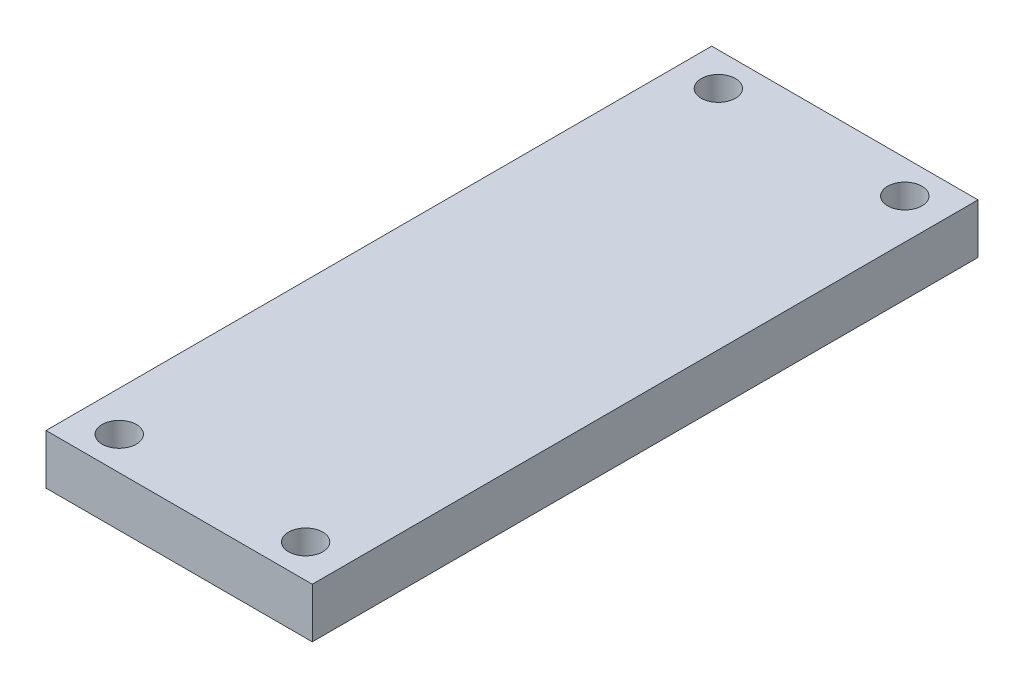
ISO-10303-21;
HEADER;
FILE_DESCRIPTION(('STEP AP214'),'2;1');
FILE_NAME('part.step','',(''),(''),'','','');
FILE_SCHEMA(('AUTOMOTIVE_DESIGN { 1 0 10303 214 1 1 1 1 }'));
ENDSEC;
DATA;
#1=APPLICATION_CONTEXT('core data for automotive mechanical design processes');
#2=APPLICATION_PROTOCOL_DEFINITION('international standard','automotive_design',2000,#1);
#3=PRODUCT_CONTEXT('',#1,'mechanical');
#4=PRODUCT('Part','Part','',(#3));
#5=PRODUCT_RELATED_PRODUCT_CATEGORY('part','',(#4));
#6=PRODUCT_DEFINITION_FORMATION('','',#4);
#7=PRODUCT_DEFINITION_CONTEXT('part definition',#1,'design');
#8=PRODUCT_DEFINITION('design','',#6,#7);
#9=PRODUCT_DEFINITION_SHAPE('','',#8);
#10=(LENGTH_UNIT() NAMED_UNIT(*) SI_UNIT(.MILLI.,.METRE.));
#11=(NAMED_UNIT(*) PLANE_ANGLE_UNIT() SI_UNIT($,.RADIAN.));
#12=(NAMED_UNIT(*) SI_UNIT($,.STERADIAN.) SOLID_ANGLE_UNIT());
#13=UNCERTAINTY_MEASURE_WITH_UNIT(LENGTH_MEASURE(1.E-05),#10,'distance_accuracy_value','');
#14=(GEOMETRIC_REPRESENTATION_CONTEXT(3) GLOBAL_UNCERTAINTY_ASSIGNED_CONTEXT((#13)) GLOBAL_UNIT_ASSIGNED_CONTEXT((#10,
#11,#12)) REPRESENTATION_CONTEXT('',''));
#15=CARTESIAN_POINT('',(0.,0.,0.));
#16=DIRECTION('',(0.,0.,1.));
#17=DIRECTION('',(1.,0.,0.));
#18=AXIS2_PLACEMENT_3D('',#15,#16,#17);
#19=CARTESIAN_POINT('',(-12.7,4.7625,-31.75));
#20=DIRECTION('',(1.,0.,0.));
#21=DIRECTION('',(0.,0.,-1.));
#22=AXIS2_PLACEMENT_3D('',#19,#20,#21);
#23=PLANE('',#22);
#24=DIRECTION('',(0.,0.,1.));
#25=VECTOR('',#24,1.);
#26=CARTESIAN_POINT('',(-12.7,0.,-31.75));
#27=LINE('',#26,#25);
#28=CARTESIAN_POINT('',(-12.7,0.,-31.75));
#29=VERTEX_POINT('',#28);
#30=CARTESIAN_POINT('',(-12.7,0.,31.75));
#31=VERTEX_POINT('',#30);
#32=EDGE_CURVE('E95',#29,#31,#27,.T.);
#33=ORIENTED_EDGE('',*,*,#32,.T.);
#34=DIRECTION('',(0.,-1.,0.));
#35=VECTOR('',#34,1.);
#36=CARTESIAN_POINT('',(-12.7,4.7625,31.75));
#37=LINE('',#36,#35);
#38=CARTESIAN_POINT('',(-12.7,4.7625,31.75));
#39=VERTEX_POINT('',#38);
#40=EDGE_CURVE('E11',#39,#31,#37,.T.);
#41=ORIENTED_EDGE('',*,*,#40,.F.);
#42=DIRECTION('',(0.,0.,1.));
#43=VECTOR('',#42,1.);
#44=CARTESIAN_POINT('',(-12.7,4.7625,-31.75));
#45=LINE('',#44,#43);
#46=CARTESIAN_POINT('',(-12.7,4.7625,-31.75));
#47=VERTEX_POINT('',#46);
#48=EDGE_CURVE('E83',#47,#39,#45,.T.);
#49=ORIENTED_EDGE('',*,*,#48,.F.);
#50=DIRECTION('',(0.,-1.,0.));
#51=VECTOR('',#50,1.);
#52=CARTESIAN_POINT('',(-12.7,4.7625,-31.75));
#53=LINE('',#52,#51);
#54=EDGE_CURVE('E91',#47,#29,#53,.T.);
#55=ORIENTED_EDGE('',*,*,#54,.T.);
#56=EDGE_LOOP('',(#33,#41,#49,#55));
#57=FACE_BOUND('',#56,.T.);
#58=ADVANCED_FACE('F32',(#57),#23,.F.);
#59=CARTESIAN_POINT('',(-12.7,4.7625,31.75));
#60=DIRECTION('',(0.,0.,-1.));
#61=DIRECTION('',(-1.,0.,0.));
#62=AXIS2_PLACEMENT_3D('',#59,#60,#61);
#63=PLANE('',#62);
#64=DIRECTION('',(1.,0.,0.));
#65=VECTOR('',#64,1.);
#66=CARTESIAN_POINT('',(-12.7,0.,31.75));
#67=LINE('',#66,#65);
#68=CARTESIAN_POINT('',(12.7,0.,31.75));
#69=VERTEX_POINT('',#68);
#70=EDGE_CURVE('E87',#31,#69,#67,.T.);
#71=ORIENTED_EDGE('',*,*,#70,.T.);
#72=DIRECTION('',(0.,-1.,0.));
#73=VECTOR('',#72,1.);
#74=CARTESIAN_POINT('',(12.7,4.7625,31.75));
#75=LINE('',#74,#73);
#76=CARTESIAN_POINT('',(12.7,4.7625,31.75));
#77=VERTEX_POINT('',#76);
#78=EDGE_CURVE('E40',#77,#69,#75,.T.);
#79=ORIENTED_EDGE('',*,*,#78,.F.);
#80=DIRECTION('',(1.,0.,0.));
#81=VECTOR('',#80,1.);
#82=CARTESIAN_POINT('',(-12.7,4.7625,31.75));
#83=LINE('',#82,#81);
#84=EDGE_CURVE('E78',#39,#77,#83,.T.);
#85=ORIENTED_EDGE('',*,*,#84,.F.);
#86=ORIENTED_EDGE('',*,*,#40,.T.);
#87=EDGE_LOOP('',(#71,#79,#85,#86));
#88=FACE_BOUND('',#87,.T.);
#89=ADVANCED_FACE('F86',(#88),#63,.F.);
#90=CARTESIAN_POINT('',(12.7,4.7625,-31.75));
#91=DIRECTION('',(-1.,0.,0.));
#92=DIRECTION('',(0.,0.,1.));
#93=AXIS2_PLACEMENT_3D('',#90,#91,#92);
#94=PLANE('',#93);
#95=DIRECTION('',(0.,0.,-1.));
#96=VECTOR('',#95,1.);
#97=CARTESIAN_POINT('',(12.7,0.,-31.75));
#98=LINE('',#97,#96);
#99=CARTESIAN_POINT('',(12.7,0.,-31.75));
#100=VERTEX_POINT('',#99);
#101=EDGE_CURVE('E65',#69,#100,#98,.T.);
#102=ORIENTED_EDGE('',*,*,#101,.T.);
#103=DIRECTION('',(0.,-1.,0.));
#104=VECTOR('',#103,1.);
#105=CARTESIAN_POINT('',(12.7,4.7625,-31.75));
#106=LINE('',#105,#104);
#107=CARTESIAN_POINT('',(12.7,4.7625,-31.75));
#108=VERTEX_POINT('',#107);
#109=EDGE_CURVE('E88',#108,#100,#106,.T.);
#110=ORIENTED_EDGE('',*,*,#109,.F.);
#111=DIRECTION('',(0.,0.,-1.));
#112=VECTOR('',#111,1.);
#113=CARTESIAN_POINT('',(12.7,4.7625,-31.75));
#114=LINE('',#113,#112);
#115=EDGE_CURVE('E81',#77,#108,#114,.T.);
#116=ORIENTED_EDGE('',*,*,#115,.F.);
#117=ORIENTED_EDGE('',*,*,#78,.T.);
#118=EDGE_LOOP('',(#102,#110,#116,#117));
#119=FACE_BOUND('',#118,.T.);
#120=ADVANCED_FACE('F89',(#119),#94,.F.);
#121=CARTESIAN_POINT('',(-12.7,4.7625,-31.75));
#122=DIRECTION('',(0.,0.,1.));
#123=DIRECTION('',(1.,0.,0.));
#124=AXIS2_PLACEMENT_3D('',#121,#122,#123);
#125=PLANE('',#124);
#126=DIRECTION('',(-1.,0.,0.));
#127=VECTOR('',#126,1.);
#128=CARTESIAN_POINT('',(-12.7,0.,-31.75));
#129=LINE('',#128,#127);
#130=EDGE_CURVE('E71',#100,#29,#129,.T.);
#131=ORIENTED_EDGE('',*,*,#130,.T.);
#132=ORIENTED_EDGE('',*,*,#54,.F.);
#133=DIRECTION('',(-1.,0.,0.));
#134=VECTOR('',#133,1.);
#135=CARTESIAN_POINT('',(-12.7,4.7625,-31.75));
#136=LINE('',#135,#134);
#137=EDGE_CURVE('E48',#108,#47,#136,.T.);
#138=ORIENTED_EDGE('',*,*,#137,.F.);
#139=ORIENTED_EDGE('',*,*,#109,.T.);
#140=EDGE_LOOP('',(#131,#132,#138,#139));
#141=FACE_BOUND('',#140,.T.);
#142=ADVANCED_FACE('F103',(#141),#125,.F.);
#143=CARTESIAN_POINT('',(-12.7,4.7625,31.75));
#144=DIRECTION('',(0.,1.,0.));
#145=DIRECTION('',(0.,0.,1.));
#146=AXIS2_PLACEMENT_3D('',#143,#144,#145);
#147=PLANE('',#146);
#148=CARTESIAN_POINT('',(-8.89000000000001,4.7625,28.575));
#149=DIRECTION('',(0.,1.,0.));
#150=DIRECTION('',(0.,0.,1.));
#151=AXIS2_PLACEMENT_3D('',#148,#149,#150);
#152=CIRCLE('',#151,1.63194999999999);
#153=CARTESIAN_POINT('',(-8.89000000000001,4.7625,30.20695));
#154=VERTEX_POINT('',#153);
#155=EDGE_CURVE('E129',#154,#154,#152,.T.);
#156=ORIENTED_EDGE('',*,*,#155,.F.);
#157=EDGE_LOOP('',(#156));
#158=FACE_BOUND('',#157,.T.);
#159=CARTESIAN_POINT('',(8.89,4.7625,28.575));
#160=DIRECTION('',(0.,1.,0.));
#161=DIRECTION('',(0.,0.,1.));
#162=AXIS2_PLACEMENT_3D('',#159,#160,#161);
#163=CIRCLE('',#162,1.63194999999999);
#164=CARTESIAN_POINT('',(8.89,4.7625,30.20695));
#165=VERTEX_POINT('',#164);
#166=EDGE_CURVE('E123',#165,#165,#163,.T.);
#167=ORIENTED_EDGE('',*,*,#166,.F.);
#168=EDGE_LOOP('',(#167));
#169=FACE_BOUND('',#168,.T.);
#170=CARTESIAN_POINT('',(-8.89000000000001,4.7625,-28.575));
#171=DIRECTION('',(0.,1.,0.));
#172=DIRECTION('',(0.,0.,1.));
#173=AXIS2_PLACEMENT_3D('',#170,#171,#172);
#174=CIRCLE('',#173,1.63194999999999);
#175=CARTESIAN_POINT('',(-8.89000000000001,4.7625,-26.94305));
#176=VERTEX_POINT('',#175);
#177=EDGE_CURVE('E117',#176,#176,#174,.T.);
#178=ORIENTED_EDGE('',*,*,#177,.F.);
#179=EDGE_LOOP('',(#178));
#180=FACE_BOUND('',#179,.T.);
#181=CARTESIAN_POINT('',(8.89,4.7625,-28.575));
#182=DIRECTION('',(0.,1.,0.));
#183=DIRECTION('',(0.,0.,1.));
#184=AXIS2_PLACEMENT_3D('',#181,#182,#183);
#185=CIRCLE('',#184,1.63194999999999);
#186=CARTESIAN_POINT('',(8.89,4.7625,-26.94305));
#187=VERTEX_POINT('',#186);
#188=EDGE_CURVE('E111',#187,#187,#185,.T.);
#189=ORIENTED_EDGE('',*,*,#188,.F.);
#190=EDGE_LOOP('',(#189));
#191=FACE_BOUND('',#190,.T.);
#192=ORIENTED_EDGE('',*,*,#48,.T.);
#193=ORIENTED_EDGE('',*,*,#84,.T.);
#194=ORIENTED_EDGE('',*,*,#115,.T.);
#195=ORIENTED_EDGE('',*,*,#137,.T.);
#196=EDGE_LOOP('',(#192,#193,#194,#195));
#197=FACE_BOUND('',#196,.T.);
#198=ADVANCED_FACE('F79',(#158,#169,#180,#191,#197),#147,.T.);
#199=CARTESIAN_POINT('',(-12.7,0.,31.75));
#200=DIRECTION('',(0.,1.,0.));
#201=DIRECTION('',(0.,0.,1.));
#202=AXIS2_PLACEMENT_3D('',#199,#200,#201);
#203=PLANE('',#202);
#204=CARTESIAN_POINT('',(-8.89000000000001,0.,28.575));
#205=DIRECTION('',(0.,1.,0.));
#206=DIRECTION('',(0.,0.,1.));
#207=AXIS2_PLACEMENT_3D('',#204,#205,#206);
#208=CIRCLE('',#207,1.63195);
#209=CARTESIAN_POINT('',(-8.89000000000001,0.,30.20695));
#210=VERTEX_POINT('',#209);
#211=EDGE_CURVE('E126',#210,#210,#208,.T.);
#212=ORIENTED_EDGE('',*,*,#211,.T.);
#213=EDGE_LOOP('',(#212));
#214=FACE_BOUND('',#213,.T.);
#215=CARTESIAN_POINT('',(8.89,0.,28.575));
#216=DIRECTION('',(0.,1.,0.));
#217=DIRECTION('',(0.,0.,1.));
#218=AXIS2_PLACEMENT_3D('',#215,#216,#217);
#219=CIRCLE('',#218,1.63195);
#220=CARTESIAN_POINT('',(8.89,0.,30.20695));
#221=VERTEX_POINT('',#220);
#222=EDGE_CURVE('E120',#221,#221,#219,.T.);
#223=ORIENTED_EDGE('',*,*,#222,.T.);
#224=EDGE_LOOP('',(#223));
#225=FACE_BOUND('',#224,.T.);
#226=CARTESIAN_POINT('',(-8.89000000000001,0.,-28.575));
#227=DIRECTION('',(0.,1.,0.));
#228=DIRECTION('',(0.,0.,1.));
#229=AXIS2_PLACEMENT_3D('',#226,#227,#228);
#230=CIRCLE('',#229,1.63195);
#231=CARTESIAN_POINT('',(-8.89000000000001,0.,-26.94305));
#232=VERTEX_POINT('',#231);
#233=EDGE_CURVE('E114',#232,#232,#230,.T.);
#234=ORIENTED_EDGE('',*,*,#233,.T.);
#235=EDGE_LOOP('',(#234));
#236=FACE_BOUND('',#235,.T.);
#237=CARTESIAN_POINT('',(8.89,0.,-28.575));
#238=DIRECTION('',(0.,1.,0.));
#239=DIRECTION('',(0.,0.,1.));
#240=AXIS2_PLACEMENT_3D('',#237,#238,#239);
#241=CIRCLE('',#240,1.63195);
#242=CARTESIAN_POINT('',(8.89,0.,-26.94305));
#243=VERTEX_POINT('',#242);
#244=EDGE_CURVE('E98',#243,#243,#241,.T.);
#245=ORIENTED_EDGE('',*,*,#244,.T.);
#246=EDGE_LOOP('',(#245));
#247=FACE_BOUND('',#246,.T.);
#248=ORIENTED_EDGE('',*,*,#32,.F.);
#249=ORIENTED_EDGE('',*,*,#130,.F.);
#250=ORIENTED_EDGE('',*,*,#101,.F.);
#251=ORIENTED_EDGE('',*,*,#70,.F.);
#252=EDGE_LOOP('',(#248,#249,#250,#251));
#253=FACE_BOUND('',#252,.T.);
#254=ADVANCED_FACE('F106',(#214,#225,#236,#247,#253),#203,.F.);
#255=CARTESIAN_POINT('',(8.89,4.7625,-28.575));
#256=DIRECTION('',(0.,1.,0.));
#257=DIRECTION('',(0.,0.,1.));
#258=AXIS2_PLACEMENT_3D('',#255,#256,#257);
#259=CYLINDRICAL_SURFACE('',#258,1.63194999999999);
#260=ORIENTED_EDGE('',*,*,#244,.F.);
#261=EDGE_LOOP('',(#260));
#262=FACE_BOUND('',#261,.T.);
#263=ORIENTED_EDGE('',*,*,#188,.T.);
#264=EDGE_LOOP('',(#263));
#265=FACE_BOUND('',#264,.T.);
#266=ADVANCED_FACE('F144',(#262,#265),#259,.F.);
#267=CARTESIAN_POINT('',(-8.89000000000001,4.7625,-28.575));
#268=DIRECTION('',(0.,1.,0.));
#269=DIRECTION('',(0.,0.,1.));
#270=AXIS2_PLACEMENT_3D('',#267,#268,#269);
#271=CYLINDRICAL_SURFACE('',#270,1.63194999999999);
#272=ORIENTED_EDGE('',*,*,#233,.F.);
#273=EDGE_LOOP('',(#272));
#274=FACE_BOUND('',#273,.T.);
#275=ORIENTED_EDGE('',*,*,#177,.T.);
#276=EDGE_LOOP('',(#275));
#277=FACE_BOUND('',#276,.T.);
#278=ADVANCED_FACE('F146',(#274,#277),#271,.F.);
#279=CARTESIAN_POINT('',(8.89,4.7625,28.575));
#280=DIRECTION('',(0.,1.,0.));
#281=DIRECTION('',(0.,0.,1.));
#282=AXIS2_PLACEMENT_3D('',#279,#280,#281);
#283=CYLINDRICAL_SURFACE('',#282,1.63194999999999);
#284=ORIENTED_EDGE('',*,*,#222,.F.);
#285=EDGE_LOOP('',(#284));
#286=FACE_BOUND('',#285,.T.);
#287=ORIENTED_EDGE('',*,*,#166,.T.);
#288=EDGE_LOOP('',(#287));
#289=FACE_BOUND('',#288,.T.);
#290=ADVANCED_FACE('F153',(#286,#289),#283,.F.);
#291=CARTESIAN_POINT('',(-8.89000000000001,4.7625,28.575));
#292=DIRECTION('',(0.,1.,0.));
#293=DIRECTION('',(0.,0.,1.));
#294=AXIS2_PLACEMENT_3D('',#291,#292,#293);
#295=CYLINDRICAL_SURFACE('',#294,1.63194999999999);
#296=ORIENTED_EDGE('',*,*,#211,.F.);
#297=EDGE_LOOP('',(#296));
#298=FACE_BOUND('',#297,.T.);
#299=ORIENTED_EDGE('',*,*,#155,.T.);
#300=EDGE_LOOP('',(#299));
#301=FACE_BOUND('',#300,.T.);
#302=ADVANCED_FACE('F133',(#298,#301),#295,.F.);
#303=CLOSED_SHELL('',(#58,#89,#120,#142,#198,#254,#266,#278,#290,#302));
#304=MANIFOLD_SOLID_BREP('B2',#303);
#305=ADVANCED_BREP_SHAPE_REPRESENTATION('',(#18,#304),#14);
#306=SHAPE_DEFINITION_REPRESENTATION(#9,#305);
ENDSEC;
END-ISO-10303-21;
